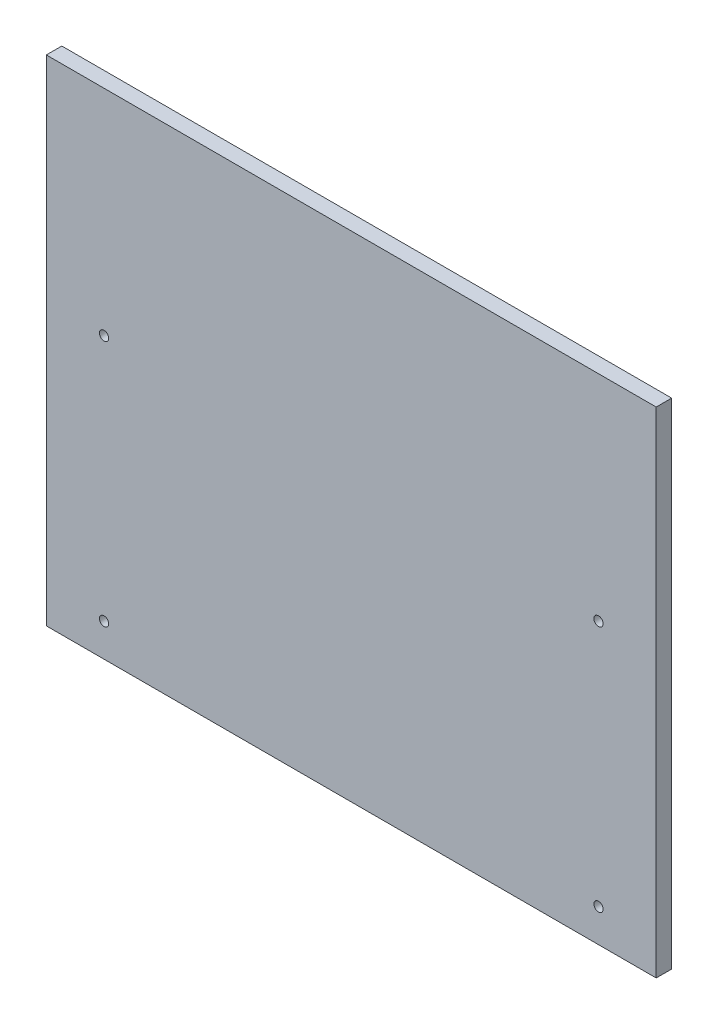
from build123d import *

# Parameters (mm, degrees)
SKETCH1_W                       = 469.9
SKETCH1_H                       = 381
BOSS_EXTRUDE1_DEPTH             = 11.90625
F_9_32_0_28125_DIAMETER_HOLE1_D = 7.14375


with BuildPart() as part:
    # Sketch1 → Boss-Extrude1 (new body)
    with BuildSketch(Plane.XY):
        Rectangle(SKETCH1_W, SKETCH1_H)
    extrude(amount=BOSS_EXTRUDE1_DEPTH)

    # 9_32 _0.28125_ Diameter Hole1 (through all)
    with Locations(Plane(origin=(-190.5, 25.4, 11.90625), x_dir=(1, 0, 0), z_dir=(0, 0, 1))):
        with Locations((0, 0), (381, 0), (381, -190.5), (0, -190.5)):
            Hole(F_9_32_0_28125_DIAMETER_HOLE1_D / 2)


solid = part.part
